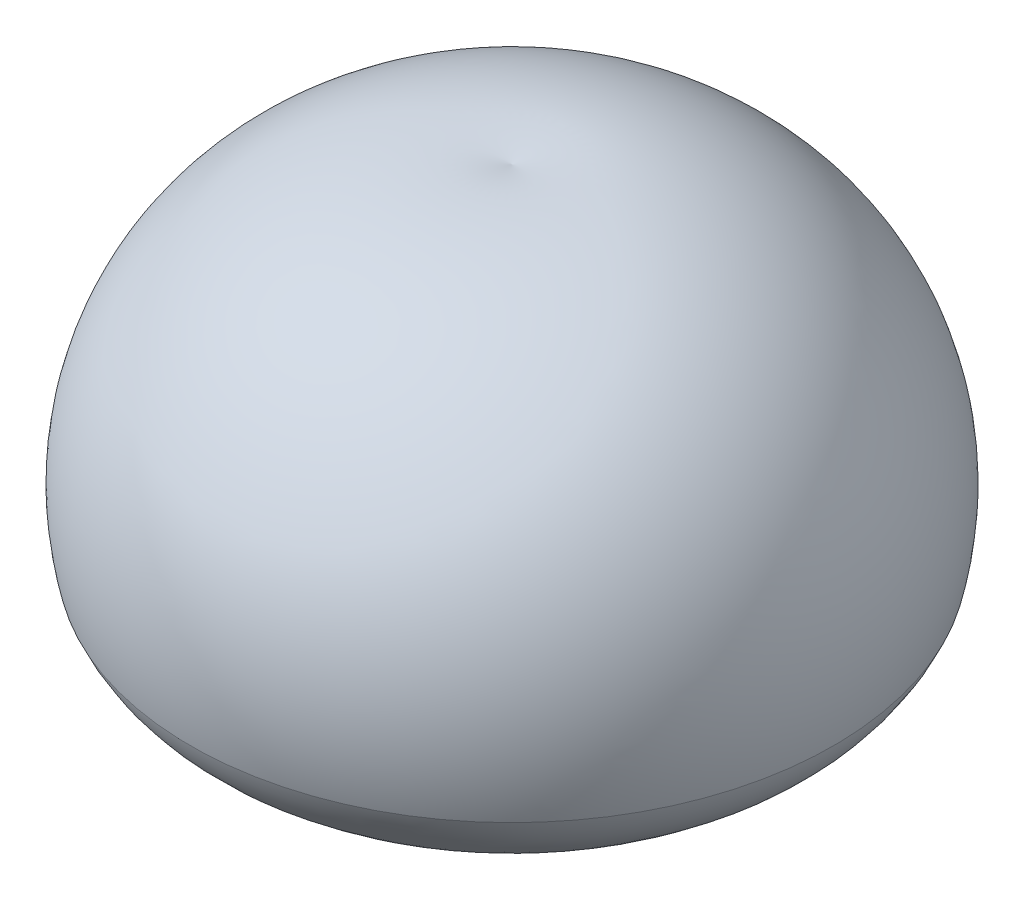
ISO-10303-21;
HEADER;
FILE_DESCRIPTION(('STEP AP214'),'2;1');
FILE_NAME('part.step','',(''),(''),'','','');
FILE_SCHEMA(('AUTOMOTIVE_DESIGN { 1 0 10303 214 1 1 1 1 }'));
ENDSEC;
DATA;
#1=APPLICATION_CONTEXT('core data for automotive mechanical design processes');
#2=APPLICATION_PROTOCOL_DEFINITION('international standard','automotive_design',2000,#1);
#3=PRODUCT_CONTEXT('',#1,'mechanical');
#4=PRODUCT('Part','Part','',(#3));
#5=PRODUCT_RELATED_PRODUCT_CATEGORY('part','',(#4));
#6=PRODUCT_DEFINITION_FORMATION('','',#4);
#7=PRODUCT_DEFINITION_CONTEXT('part definition',#1,'design');
#8=PRODUCT_DEFINITION('design','',#6,#7);
#9=PRODUCT_DEFINITION_SHAPE('','',#8);
#10=(LENGTH_UNIT() NAMED_UNIT(*) SI_UNIT(.MILLI.,.METRE.));
#11=(NAMED_UNIT(*) PLANE_ANGLE_UNIT() SI_UNIT($,.RADIAN.));
#12=(NAMED_UNIT(*) SI_UNIT($,.STERADIAN.) SOLID_ANGLE_UNIT());
#13=UNCERTAINTY_MEASURE_WITH_UNIT(LENGTH_MEASURE(1.E-05),#10,'distance_accuracy_value','');
#14=(GEOMETRIC_REPRESENTATION_CONTEXT(3) GLOBAL_UNCERTAINTY_ASSIGNED_CONTEXT((#13)) GLOBAL_UNIT_ASSIGNED_CONTEXT((#10,
#11,#12)) REPRESENTATION_CONTEXT('',''));
#15=CARTESIAN_POINT('',(0.,0.,0.));
#16=DIRECTION('',(0.,0.,1.));
#17=DIRECTION('',(1.,0.,0.));
#18=AXIS2_PLACEMENT_3D('',#15,#16,#17);
#19=CARTESIAN_POINT('',(0.,1134.11237799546,734.962845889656));
#20=DIRECTION('',(-1.,0.,0.));
#21=DIRECTION('',(0.,0.,-1.));
#22=AXIS2_PLACEMENT_3D('',#19,#20,#21);
#23=CIRCLE('',#22,1152.76520111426);
#24=TRIMMED_CURVE('',#23,(PARAMETER_VALUE(-0.879462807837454)),
(PARAMETER_VALUE(0.879462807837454)),.T.,.PARAMETER.);
#25=CARTESIAN_POINT('',(0.,1134.11237799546,0.));
#26=DIRECTION('',(0.,-1.,0.));
#27=AXIS1_PLACEMENT('',#25,#26);
#28=SURFACE_OF_REVOLUTION('',#24,#27);
#29=CARTESIAN_POINT('',(0.,2022.19864861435,0.));
#30=VERTEX_POINT('',#29);
#31=VERTEX_LOOP('',#30);
#32=FACE_BOUND('',#31,.T.);
#33=CARTESIAN_POINT('',(0.,1462.00244315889,0.));
#34=DIRECTION('',(0.,-1.,0.));
#35=DIRECTION('',(0.,0.,-1.));
#36=AXIS2_PLACEMENT_3D('',#33,#34,#35);
#37=CIRCLE('',#36,370.186788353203);
#38=CARTESIAN_POINT('',(0.,1462.00244315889,-370.186788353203));
#39=VERTEX_POINT('',#38);
#40=EDGE_CURVE('E34',#39,#39,#37,.T.);
#41=ORIENTED_EDGE('',*,*,#40,.T.);
#42=EDGE_LOOP('',(#41));
#43=FACE_BOUND('',#42,.T.);
#44=ADVANCED_FACE('F16',(#32,#43),#28,.F.);
#45=CARTESIAN_POINT('',(0.,830.,-400.));
#46=DIRECTION('',(-1.,0.,0.));
#47=DIRECTION('',(0.,0.,-1.));
#48=AXIS2_PLACEMENT_3D('',#45,#46,#47);
#49=CIRCLE('',#48,2300.75397921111);
#50=TRIMMED_CURVE('',#49,(PARAMETER_VALUE(-1.74554033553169)),
(PARAMETER_VALUE(1.74554033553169)),.T.,.PARAMETER.);
#51=CARTESIAN_POINT('',(0.,830.,0.));
#52=DIRECTION('',(0.,-1.,0.));
#53=AXIS1_PLACEMENT('',#51,#52);
#54=SURFACE_OF_REVOLUTION('',#50,#53);
#55=CARTESIAN_POINT('',(0.,286.917242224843,0.));
#56=DIRECTION('',(0.,-1.,0.));
#57=DIRECTION('',(0.,0.,-1.));
#58=AXIS2_PLACEMENT_3D('',#55,#56,#57);
#59=CIRCLE('',#58,2635.7392493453);
#60=CARTESIAN_POINT('',(0.,286.917242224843,-2635.7392493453));
#61=VERTEX_POINT('',#60);
#62=EDGE_CURVE('E10',#61,#61,#59,.T.);
#63=ORIENTED_EDGE('',*,*,#62,.F.);
#64=EDGE_LOOP('',(#63));
#65=FACE_BOUND('',#64,.T.);
#66=CARTESIAN_POINT('',(0.,3095.71597356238,0.));
#67=VERTEX_POINT('',#66);
#68=VERTEX_LOOP('',#67);
#69=FACE_BOUND('',#68,.T.);
#70=ADVANCED_FACE('F31',(#65,#69),#54,.T.);
#71=CARTESIAN_POINT('',(0.,727.592002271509,0.));
#72=DIRECTION('',(0.,-1.,0.));
#73=DIRECTION('',(0.,0.,-1.));
#74=AXIS2_PLACEMENT_3D('',#71,#72,#73);
#75=TOROIDAL_SURFACE('',#74,1570.5287702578,1152.76520111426);
#76=CARTESIAN_POINT('',(0.,41.4926913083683,0.));
#77=DIRECTION('',(0.,-1.,0.));
#78=DIRECTION('',(0.,0.,-1.));
#79=AXIS2_PLACEMENT_3D('',#76,#77,#78);
#80=CIRCLE('',#79,644.172821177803);
#81=CARTESIAN_POINT('',(0.,41.4926913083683,-644.172821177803));
#82=VERTEX_POINT('',#81);
#83=EDGE_CURVE('E23',#82,#82,#80,.T.);
#84=ORIENTED_EDGE('',*,*,#83,.F.);
#85=EDGE_LOOP('',(#84));
#86=FACE_BOUND('',#85,.T.);
#87=ORIENTED_EDGE('',*,*,#62,.T.);
#88=EDGE_LOOP('',(#87));
#89=FACE_BOUND('',#88,.T.);
#90=ADVANCED_FACE('F45',(#86,#89),#75,.T.);
#91=CARTESIAN_POINT('',(0.,0.,0.));
#92=DIRECTION('',(0.,-1.,0.));
#93=DIRECTION('',(0.,0.,-1.));
#94=AXIS2_PLACEMENT_3D('',#91,#92,#93);
#95=CYLINDRICAL_SURFACE('',#94,644.172821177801);
#96=CARTESIAN_POINT('',(0.,246.308686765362,0.));
#97=DIRECTION('',(0.,-1.,0.));
#98=DIRECTION('',(0.,0.,-1.));
#99=AXIS2_PLACEMENT_3D('',#96,#97,#98);
#100=CIRCLE('',#99,644.172821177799);
#101=CARTESIAN_POINT('',(0.,246.308686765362,-644.172821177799));
#102=VERTEX_POINT('',#101);
#103=EDGE_CURVE('E36',#102,#102,#100,.T.);
#104=ORIENTED_EDGE('',*,*,#103,.F.);
#105=EDGE_LOOP('',(#104));
#106=FACE_BOUND('',#105,.T.);
#107=ORIENTED_EDGE('',*,*,#83,.T.);
#108=EDGE_LOOP('',(#107));
#109=FACE_BOUND('',#108,.T.);
#110=ADVANCED_FACE('F43',(#106,#109),#95,.F.);
#111=CARTESIAN_POINT('',(0.,830.,0.));
#112=DIRECTION('',(0.,-1.,0.));
#113=DIRECTION('',(0.,0.,-1.));
#114=AXIS2_PLACEMENT_3D('',#111,#112,#113);
#115=DEGENERATE_TOROIDAL_SURFACE('',#114,400.,632.705236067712,.T.);
#116=ORIENTED_EDGE('',*,*,#40,.F.);
#117=EDGE_LOOP('',(#116));
#118=FACE_BOUND('',#117,.T.);
#119=ORIENTED_EDGE('',*,*,#103,.T.);
#120=EDGE_LOOP('',(#119));
#121=FACE_BOUND('',#120,.T.);
#122=ADVANCED_FACE('F59',(#118,#121),#115,.F.);
#123=CLOSED_SHELL('',(#44,#70,#90,#110,#122));
#124=MANIFOLD_SOLID_BREP('B1',#123);
#125=ADVANCED_BREP_SHAPE_REPRESENTATION('',(#18,#124),#14);
#126=SHAPE_DEFINITION_REPRESENTATION(#9,#125);
ENDSEC;
END-ISO-10303-21;
